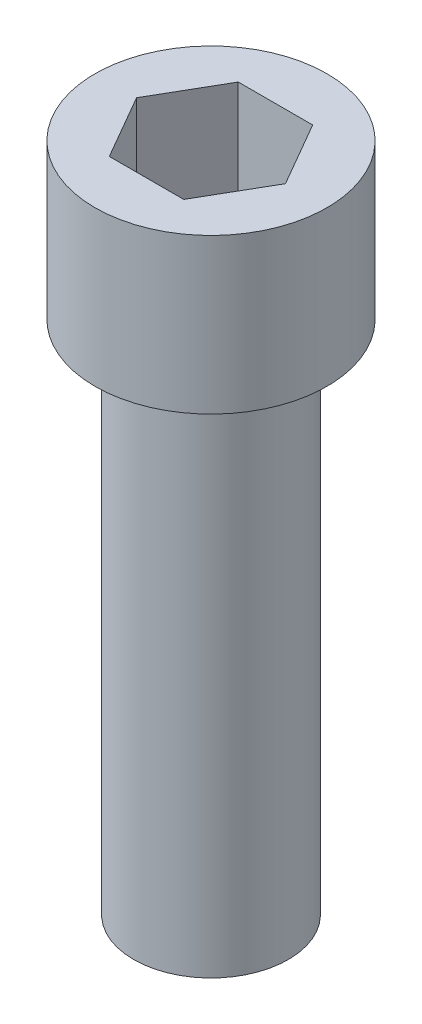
ISO-10303-21;
HEADER;
FILE_DESCRIPTION(('STEP AP214'),'2;1');
FILE_NAME('part.step','',(''),(''),'','','');
FILE_SCHEMA(('AUTOMOTIVE_DESIGN { 1 0 10303 214 1 1 1 1 }'));
ENDSEC;
DATA;
#1=APPLICATION_CONTEXT('core data for automotive mechanical design processes');
#2=APPLICATION_PROTOCOL_DEFINITION('international standard','automotive_design',2000,#1);
#3=PRODUCT_CONTEXT('',#1,'mechanical');
#4=PRODUCT('Part','Part','',(#3));
#5=PRODUCT_RELATED_PRODUCT_CATEGORY('part','',(#4));
#6=PRODUCT_DEFINITION_FORMATION('','',#4);
#7=PRODUCT_DEFINITION_CONTEXT('part definition',#1,'design');
#8=PRODUCT_DEFINITION('design','',#6,#7);
#9=PRODUCT_DEFINITION_SHAPE('','',#8);
#10=(LENGTH_UNIT() NAMED_UNIT(*) SI_UNIT(.MILLI.,.METRE.));
#11=(NAMED_UNIT(*) PLANE_ANGLE_UNIT() SI_UNIT($,.RADIAN.));
#12=(NAMED_UNIT(*) SI_UNIT($,.STERADIAN.) SOLID_ANGLE_UNIT());
#13=UNCERTAINTY_MEASURE_WITH_UNIT(LENGTH_MEASURE(1.E-05),#10,'distance_accuracy_value','');
#14=(GEOMETRIC_REPRESENTATION_CONTEXT(3) GLOBAL_UNCERTAINTY_ASSIGNED_CONTEXT((#13)) GLOBAL_UNIT_ASSIGNED_CONTEXT((#10,
#11,#12)) REPRESENTATION_CONTEXT('',''));
#15=CARTESIAN_POINT('',(0.,0.,0.));
#16=DIRECTION('',(0.,0.,1.));
#17=DIRECTION('',(1.,0.,0.));
#18=AXIS2_PLACEMENT_3D('',#15,#16,#17);
#19=CARTESIAN_POINT('',(0.,-63.5,0.));
#20=DIRECTION('',(0.,1.,0.));
#21=DIRECTION('',(0.,0.,1.));
#22=AXIS2_PLACEMENT_3D('',#19,#20,#21);
#23=CYLINDRICAL_SURFACE('',#22,9.525);
#24=CARTESIAN_POINT('',(0.,-63.5,0.));
#25=DIRECTION('',(0.,1.,0.));
#26=DIRECTION('',(0.,0.,1.));
#27=AXIS2_PLACEMENT_3D('',#24,#25,#26);
#28=CIRCLE('',#27,9.525);
#29=CARTESIAN_POINT('',(0.,-63.5,9.525));
#30=VERTEX_POINT('',#29);
#31=EDGE_CURVE('E11',#30,#30,#28,.T.);
#32=ORIENTED_EDGE('',*,*,#31,.T.);
#33=EDGE_LOOP('',(#32));
#34=FACE_BOUND('',#33,.T.);
#35=CARTESIAN_POINT('',(0.,0.,0.));
#36=DIRECTION('',(0.,1.,0.));
#37=DIRECTION('',(0.,0.,1.));
#38=AXIS2_PLACEMENT_3D('',#35,#36,#37);
#39=CIRCLE('',#38,9.525);
#40=CARTESIAN_POINT('',(0.,0.,9.525));
#41=VERTEX_POINT('',#40);
#42=EDGE_CURVE('E43',#41,#41,#39,.T.);
#43=ORIENTED_EDGE('',*,*,#42,.F.);
#44=EDGE_LOOP('',(#43));
#45=FACE_BOUND('',#44,.T.);
#46=ADVANCED_FACE('F40',(#34,#45),#23,.T.);
#47=CARTESIAN_POINT('',(0.,-63.5,0.));
#48=DIRECTION('',(0.,1.,0.));
#49=DIRECTION('',(0.,0.,1.));
#50=AXIS2_PLACEMENT_3D('',#47,#48,#49);
#51=PLANE('',#50);
#52=ORIENTED_EDGE('',*,*,#31,.F.);
#53=EDGE_LOOP('',(#52));
#54=FACE_BOUND('',#53,.T.);
#55=ADVANCED_FACE('F172',(#54),#51,.F.);
#56=CARTESIAN_POINT('',(0.,19.05,0.));
#57=DIRECTION('',(0.,-1.,0.));
#58=DIRECTION('',(0.,0.,-1.));
#59=AXIS2_PLACEMENT_3D('',#56,#57,#58);
#60=CYLINDRICAL_SURFACE('',#59,14.2875);
#61=CARTESIAN_POINT('',(0.,19.05,0.));
#62=DIRECTION('',(0.,1.,0.));
#63=DIRECTION('',(0.,0.,1.));
#64=AXIS2_PLACEMENT_3D('',#61,#62,#63);
#65=CIRCLE('',#64,14.2875);
#66=CARTESIAN_POINT('',(0.,19.05,-14.2875));
#67=VERTEX_POINT('',#66);
#68=EDGE_CURVE('E147',#67,#67,#65,.T.);
#69=CARTESIAN_POINT('',(0.,0.,0.));
#70=DIRECTION('',(0.,1.,0.));
#71=DIRECTION('',(0.,0.,1.));
#72=AXIS2_PLACEMENT_3D('',#69,#70,#71);
#73=CIRCLE('',#72,14.2875);
#74=CARTESIAN_POINT('',(0.,0.,-14.2875));
#75=VERTEX_POINT('',#74);
#76=EDGE_CURVE('E141',#75,#75,#73,.T.);
#77=CARTESIAN_POINT('',(0.,19.05,-14.2875));
#78=CARTESIAN_POINT('',(0.,18.8515625,-14.2875));
#79=CARTESIAN_POINT('',(0.,18.653125,-14.2875));
#80=CARTESIAN_POINT('',(0.,18.25625,-14.2875));
#81=CARTESIAN_POINT('',(0.,18.0578125,-14.2875));
#82=CARTESIAN_POINT('',(0.,17.6609375,-14.2875));
#83=CARTESIAN_POINT('',(0.,17.4625,-14.2875));
#84=CARTESIAN_POINT('',(0.,17.065625,-14.2875));
#85=CARTESIAN_POINT('',(0.,16.8671875,-14.2875));
#86=CARTESIAN_POINT('',(0.,16.4703125,-14.2875));
#87=CARTESIAN_POINT('',(0.,16.271875,-14.2875));
#88=CARTESIAN_POINT('',(0.,15.875,-14.2875));
#89=CARTESIAN_POINT('',(0.,15.6765625,-14.2875));
#90=CARTESIAN_POINT('',(0.,15.2796875,-14.2875));
#91=CARTESIAN_POINT('',(0.,15.08125,-14.2875));
#92=CARTESIAN_POINT('',(0.,14.684375,-14.2875));
#93=CARTESIAN_POINT('',(0.,14.4859375,-14.2875));
#94=CARTESIAN_POINT('',(0.,14.0890625,-14.2875));
#95=CARTESIAN_POINT('',(0.,13.890625,-14.2875));
#96=CARTESIAN_POINT('',(0.,13.49375,-14.2875));
#97=CARTESIAN_POINT('',(0.,13.2953125,-14.2875));
#98=CARTESIAN_POINT('',(0.,12.8984375,-14.2875));
#99=CARTESIAN_POINT('',(0.,12.7,-14.2875));
#100=CARTESIAN_POINT('',(0.,12.303125,-14.2875));
#101=CARTESIAN_POINT('',(0.,12.1046875,-14.2875));
#102=CARTESIAN_POINT('',(0.,11.7078125,-14.2875));
#103=CARTESIAN_POINT('',(0.,11.509375,-14.2875));
#104=CARTESIAN_POINT('',(0.,11.1125,-14.2875));
#105=CARTESIAN_POINT('',(0.,10.9140625,-14.2875));
#106=CARTESIAN_POINT('',(0.,10.5171875,-14.2875));
#107=CARTESIAN_POINT('',(0.,10.31875,-14.2875));
#108=CARTESIAN_POINT('',(0.,9.921875,-14.2875));
#109=CARTESIAN_POINT('',(0.,9.7234375,-14.2875));
#110=CARTESIAN_POINT('',(0.,9.3265625,-14.2875));
#111=CARTESIAN_POINT('',(0.,9.128125,-14.2875));
#112=CARTESIAN_POINT('',(0.,8.73125,-14.2875));
#113=CARTESIAN_POINT('',(0.,8.5328125,-14.2875));
#114=CARTESIAN_POINT('',(0.,8.1359375,-14.2875));
#115=CARTESIAN_POINT('',(0.,7.9375,-14.2875));
#116=CARTESIAN_POINT('',(0.,7.540625,-14.2875));
#117=CARTESIAN_POINT('',(0.,7.3421875,-14.2875));
#118=CARTESIAN_POINT('',(0.,6.9453125,-14.2875));
#119=CARTESIAN_POINT('',(0.,6.746875,-14.2875));
#120=CARTESIAN_POINT('',(0.,6.35,-14.2875));
#121=CARTESIAN_POINT('',(0.,6.1515625,-14.2875));
#122=CARTESIAN_POINT('',(0.,5.7546875,-14.2875));
#123=CARTESIAN_POINT('',(0.,5.55625,-14.2875));
#124=CARTESIAN_POINT('',(0.,5.159375,-14.2875));
#125=CARTESIAN_POINT('',(0.,4.9609375,-14.2875));
#126=CARTESIAN_POINT('',(0.,4.5640625,-14.2875));
#127=CARTESIAN_POINT('',(0.,4.365625,-14.2875));
#128=CARTESIAN_POINT('',(0.,3.96875,-14.2875));
#129=CARTESIAN_POINT('',(0.,3.7703125,-14.2875));
#130=CARTESIAN_POINT('',(0.,3.3734375,-14.2875));
#131=CARTESIAN_POINT('',(0.,3.175,-14.2875));
#132=CARTESIAN_POINT('',(0.,2.778125,-14.2875));
#133=CARTESIAN_POINT('',(0.,2.5796875,-14.2875));
#134=CARTESIAN_POINT('',(0.,2.1828125,-14.2875));
#135=CARTESIAN_POINT('',(0.,1.984375,-14.2875));
#136=CARTESIAN_POINT('',(0.,1.5875,-14.2875));
#137=CARTESIAN_POINT('',(0.,1.3890625,-14.2875));
#138=CARTESIAN_POINT('',(0.,0.992187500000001,-14.2875));
#139=CARTESIAN_POINT('',(0.,0.793750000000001,-14.2875));
#140=CARTESIAN_POINT('',(0.,0.396875,-14.2875));
#141=CARTESIAN_POINT('',(0.,0.1984375,-14.2875));
#142=CARTESIAN_POINT('',(0.,0.,-14.2875));
#143=B_SPLINE_CURVE_WITH_KNOTS('',3,(#77,#78,#79,#80,#81,#82,#83,#84,#85,#86,#87,#88,#89,#90,
#91,#92,#93,#94,#95,#96,#97,#98,#99,#100,#101,#102,#103,#104,#105,#106,#107,#108,#109,#110,#111,
#112,#113,#114,#115,#116,#117,#118,#119,#120,#121,#122,#123,#124,#125,#126,#127,#128,#129,#130,
#131,#132,#133,#134,#135,#136,#137,#138,#139,#140,#141,#142),.UNSPECIFIED.,.F.,.F.,(4,2,2,2,2,2,
2,2,2,2,2,2,2,2,2,2,2,2,2,2,2,2,2,2,2,2,2,2,2,2,2,2,4),(0.,0.5953125,1.190625,1.7859375,2.38125,
2.9765625,3.571875,4.1671875,4.7625,5.3578125,5.953125,6.5484375,7.14375,7.7390625,8.334375,
8.9296875,9.525,10.1203125,10.715625,11.3109375,11.90625,12.5015625,13.096875,13.6921875,
14.2875,14.8828125,15.478125,16.0734375,16.66875,17.2640625,17.859375,18.4546875,19.05),.UNSPECIFIED.);
#144=EDGE_CURVE('BSEAM153',#67,#75,#143,.T.);
#145=ORIENTED_EDGE('',*,*,#68,.F.);
#146=ORIENTED_EDGE('',*,*,#76,.T.);
#147=ORIENTED_EDGE('',*,*,#144,.T.);
#148=ORIENTED_EDGE('',*,*,#144,.F.);
#149=EDGE_LOOP('',(#145,#147,#146,#148));
#150=FACE_BOUND('',#149,.T.);
#151=ADVANCED_FACE('F153',(#150),#60,.T.);
#152=CARTESIAN_POINT('',(0.,19.05,0.));
#153=DIRECTION('',(0.,1.,0.));
#154=DIRECTION('',(0.,0.,1.));
#155=AXIS2_PLACEMENT_3D('',#152,#153,#154);
#156=PLANE('',#155);
#157=DIRECTION('',(0.5,0.,-0.866025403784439));
#158=VECTOR('',#157,1.);
#159=CARTESIAN_POINT('',(4.58271776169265,19.05,7.93750000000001));
#160=LINE('',#159,#158);
#161=CARTESIAN_POINT('',(4.58271776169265,19.05,7.93750000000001));
#162=VERTEX_POINT('',#161);
#163=CARTESIAN_POINT('',(9.16543552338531,19.05,0.));
#164=VERTEX_POINT('',#163);
#165=EDGE_CURVE('E54',#162,#164,#160,.T.);
#166=ORIENTED_EDGE('',*,*,#165,.F.);
#167=DIRECTION('',(1.,0.,0.));
#168=VECTOR('',#167,1.);
#169=CARTESIAN_POINT('',(-4.58271776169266,19.05,7.9375));
#170=LINE('',#169,#168);
#171=CARTESIAN_POINT('',(-4.58271776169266,19.05,7.9375));
#172=VERTEX_POINT('',#171);
#173=EDGE_CURVE('E137',#172,#162,#170,.T.);
#174=ORIENTED_EDGE('',*,*,#173,.F.);
#175=DIRECTION('',(0.5,0.,0.866025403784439));
#176=VECTOR('',#175,1.);
#177=CARTESIAN_POINT('',(-9.16543552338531,19.05,0.));
#178=LINE('',#177,#176);
#179=CARTESIAN_POINT('',(-9.16543552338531,19.05,0.));
#180=VERTEX_POINT('',#179);
#181=EDGE_CURVE('E135',#180,#172,#178,.T.);
#182=ORIENTED_EDGE('',*,*,#181,.F.);
#183=DIRECTION('',(-0.5,0.,0.866025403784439));
#184=VECTOR('',#183,1.);
#185=CARTESIAN_POINT('',(-4.58271776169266,19.05,-7.93750000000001));
#186=LINE('',#185,#184);
#187=CARTESIAN_POINT('',(-4.58271776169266,19.05,-7.93750000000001));
#188=VERTEX_POINT('',#187);
#189=EDGE_CURVE('E102',#188,#180,#186,.T.);
#190=ORIENTED_EDGE('',*,*,#189,.F.);
#191=DIRECTION('',(-1.,0.,0.));
#192=VECTOR('',#191,1.);
#193=CARTESIAN_POINT('',(4.58271776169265,19.05,-7.93750000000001));
#194=LINE('',#193,#192);
#195=CARTESIAN_POINT('',(4.58271776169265,19.05,-7.93750000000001));
#196=VERTEX_POINT('',#195);
#197=EDGE_CURVE('E131',#196,#188,#194,.T.);
#198=ORIENTED_EDGE('',*,*,#197,.F.);
#199=DIRECTION('',(-0.5,0.,-0.866025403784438));
#200=VECTOR('',#199,1.);
#201=CARTESIAN_POINT('',(9.16543552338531,19.05,0.));
#202=LINE('',#201,#200);
#203=EDGE_CURVE('E128',#164,#196,#202,.T.);
#204=ORIENTED_EDGE('',*,*,#203,.F.);
#205=EDGE_LOOP('',(#166,#174,#182,#190,#198,#204));
#206=FACE_BOUND('',#205,.T.);
#207=ORIENTED_EDGE('',*,*,#68,.T.);
#208=EDGE_LOOP('',(#207));
#209=FACE_BOUND('',#208,.T.);
#210=ADVANCED_FACE('F158',(#206,#209),#156,.T.);
#211=CARTESIAN_POINT('',(0.,0.,0.));
#212=DIRECTION('',(0.,1.,0.));
#213=DIRECTION('',(0.,0.,1.));
#214=AXIS2_PLACEMENT_3D('',#211,#212,#213);
#215=PLANE('',#214);
#216=ORIENTED_EDGE('',*,*,#42,.T.);
#217=EDGE_LOOP('',(#216));
#218=FACE_BOUND('',#217,.T.);
#219=ORIENTED_EDGE('',*,*,#76,.F.);
#220=EDGE_LOOP('',(#219));
#221=FACE_BOUND('',#220,.T.);
#222=ADVANCED_FACE('F155',(#218,#221),#215,.F.);
#223=CARTESIAN_POINT('',(4.58271776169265,6.35,7.93750000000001));
#224=DIRECTION('',(0.866025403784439,0.,0.5));
#225=DIRECTION('',(0.5,0.,-0.866025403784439));
#226=AXIS2_PLACEMENT_3D('',#223,#224,#225);
#227=PLANE('',#226);
#228=ORIENTED_EDGE('',*,*,#165,.T.);
#229=DIRECTION('',(0.,1.,0.));
#230=VECTOR('',#229,1.);
#231=CARTESIAN_POINT('',(9.16543552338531,6.35,0.));
#232=LINE('',#231,#230);
#233=CARTESIAN_POINT('',(9.16543552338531,6.35,0.));
#234=VERTEX_POINT('',#233);
#235=EDGE_CURVE('E84',#234,#164,#232,.T.);
#236=ORIENTED_EDGE('',*,*,#235,.F.);
#237=DIRECTION('',(0.5,0.,-0.866025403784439));
#238=VECTOR('',#237,1.);
#239=CARTESIAN_POINT('',(4.58271776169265,6.35,7.93750000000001));
#240=LINE('',#239,#238);
#241=CARTESIAN_POINT('',(4.58271776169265,6.35,7.93750000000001));
#242=VERTEX_POINT('',#241);
#243=EDGE_CURVE('E139',#242,#234,#240,.T.);
#244=ORIENTED_EDGE('',*,*,#243,.F.);
#245=DIRECTION('',(0.,1.,0.));
#246=VECTOR('',#245,1.);
#247=CARTESIAN_POINT('',(4.58271776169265,6.35,7.93750000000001));
#248=LINE('',#247,#246);
#249=EDGE_CURVE('E62',#242,#162,#248,.T.);
#250=ORIENTED_EDGE('',*,*,#249,.T.);
#251=EDGE_LOOP('',(#228,#236,#244,#250));
#252=FACE_BOUND('',#251,.T.);
#253=ADVANCED_FACE('F157',(#252),#227,.F.);
#254=CARTESIAN_POINT('',(-4.58271776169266,6.35,7.9375));
#255=DIRECTION('',(0.,0.,1.));
#256=DIRECTION('',(1.,0.,0.));
#257=AXIS2_PLACEMENT_3D('',#254,#255,#256);
#258=PLANE('',#257);
#259=ORIENTED_EDGE('',*,*,#173,.T.);
#260=ORIENTED_EDGE('',*,*,#249,.F.);
#261=DIRECTION('',(1.,0.,0.));
#262=VECTOR('',#261,1.);
#263=CARTESIAN_POINT('',(-4.58271776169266,6.35,7.9375));
#264=LINE('',#263,#262);
#265=CARTESIAN_POINT('',(-4.58271776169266,6.35,7.9375));
#266=VERTEX_POINT('',#265);
#267=EDGE_CURVE('E114',#266,#242,#264,.T.);
#268=ORIENTED_EDGE('',*,*,#267,.F.);
#269=DIRECTION('',(0.,1.,0.));
#270=VECTOR('',#269,1.);
#271=CARTESIAN_POINT('',(-4.58271776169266,6.35,7.9375));
#272=LINE('',#271,#270);
#273=EDGE_CURVE('E106',#266,#172,#272,.T.);
#274=ORIENTED_EDGE('',*,*,#273,.T.);
#275=EDGE_LOOP('',(#259,#260,#268,#274));
#276=FACE_BOUND('',#275,.T.);
#277=ADVANCED_FACE('F165',(#276),#258,.F.);
#278=CARTESIAN_POINT('',(-9.16543552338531,6.35,0.));
#279=DIRECTION('',(-0.866025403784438,0.,0.5));
#280=DIRECTION('',(0.5,0.,0.866025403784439));
#281=AXIS2_PLACEMENT_3D('',#278,#279,#280);
#282=PLANE('',#281);
#283=ORIENTED_EDGE('',*,*,#181,.T.);
#284=ORIENTED_EDGE('',*,*,#273,.F.);
#285=DIRECTION('',(0.5,0.,0.866025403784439));
#286=VECTOR('',#285,1.);
#287=CARTESIAN_POINT('',(-9.16543552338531,6.35,0.));
#288=LINE('',#287,#286);
#289=CARTESIAN_POINT('',(-9.16543552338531,6.35,0.));
#290=VERTEX_POINT('',#289);
#291=EDGE_CURVE('E110',#290,#266,#288,.T.);
#292=ORIENTED_EDGE('',*,*,#291,.F.);
#293=DIRECTION('',(0.,1.,0.));
#294=VECTOR('',#293,1.);
#295=CARTESIAN_POINT('',(-9.16543552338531,6.35,0.));
#296=LINE('',#295,#294);
#297=EDGE_CURVE('E95',#290,#180,#296,.T.);
#298=ORIENTED_EDGE('',*,*,#297,.T.);
#299=EDGE_LOOP('',(#283,#284,#292,#298));
#300=FACE_BOUND('',#299,.T.);
#301=ADVANCED_FACE('F111',(#300),#282,.F.);
#302=CARTESIAN_POINT('',(-4.58271776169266,6.35,-7.93750000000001));
#303=DIRECTION('',(-0.866025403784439,0.,-0.5));
#304=DIRECTION('',(-0.5,0.,0.866025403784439));
#305=AXIS2_PLACEMENT_3D('',#302,#303,#304);
#306=PLANE('',#305);
#307=ORIENTED_EDGE('',*,*,#189,.T.);
#308=ORIENTED_EDGE('',*,*,#297,.F.);
#309=DIRECTION('',(-0.5,0.,0.866025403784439));
#310=VECTOR('',#309,1.);
#311=CARTESIAN_POINT('',(-4.58271776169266,6.35,-7.93750000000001));
#312=LINE('',#311,#310);
#313=CARTESIAN_POINT('',(-4.58271776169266,6.35,-7.93750000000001));
#314=VERTEX_POINT('',#313);
#315=EDGE_CURVE('E99',#314,#290,#312,.T.);
#316=ORIENTED_EDGE('',*,*,#315,.F.);
#317=DIRECTION('',(0.,1.,0.));
#318=VECTOR('',#317,1.);
#319=CARTESIAN_POINT('',(-4.58271776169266,6.35,-7.93750000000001));
#320=LINE('',#319,#318);
#321=EDGE_CURVE('E107',#314,#188,#320,.T.);
#322=ORIENTED_EDGE('',*,*,#321,.T.);
#323=EDGE_LOOP('',(#307,#308,#316,#322));
#324=FACE_BOUND('',#323,.T.);
#325=ADVANCED_FACE('F97',(#324),#306,.F.);
#326=CARTESIAN_POINT('',(4.58271776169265,6.35,-7.93750000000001));
#327=DIRECTION('',(0.,0.,-1.));
#328=DIRECTION('',(-1.,0.,0.));
#329=AXIS2_PLACEMENT_3D('',#326,#327,#328);
#330=PLANE('',#329);
#331=ORIENTED_EDGE('',*,*,#197,.T.);
#332=ORIENTED_EDGE('',*,*,#321,.F.);
#333=DIRECTION('',(-1.,0.,0.));
#334=VECTOR('',#333,1.);
#335=CARTESIAN_POINT('',(4.58271776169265,6.35,-7.93750000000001));
#336=LINE('',#335,#334);
#337=CARTESIAN_POINT('',(4.58271776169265,6.35,-7.93750000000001));
#338=VERTEX_POINT('',#337);
#339=EDGE_CURVE('E120',#338,#314,#336,.T.);
#340=ORIENTED_EDGE('',*,*,#339,.F.);
#341=DIRECTION('',(0.,1.,0.));
#342=VECTOR('',#341,1.);
#343=CARTESIAN_POINT('',(4.58271776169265,6.35,-7.93750000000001));
#344=LINE('',#343,#342);
#345=EDGE_CURVE('E144',#338,#196,#344,.T.);
#346=ORIENTED_EDGE('',*,*,#345,.T.);
#347=EDGE_LOOP('',(#331,#332,#340,#346));
#348=FACE_BOUND('',#347,.T.);
#349=ADVANCED_FACE('F226',(#348),#330,.F.);
#350=CARTESIAN_POINT('',(9.16543552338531,6.35,0.));
#351=DIRECTION('',(0.866025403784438,0.,-0.5));
#352=DIRECTION('',(-0.5,0.,-0.866025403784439));
#353=AXIS2_PLACEMENT_3D('',#350,#351,#352);
#354=PLANE('',#353);
#355=ORIENTED_EDGE('',*,*,#203,.T.);
#356=ORIENTED_EDGE('',*,*,#345,.F.);
#357=DIRECTION('',(-0.5,0.,-0.866025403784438));
#358=VECTOR('',#357,1.);
#359=CARTESIAN_POINT('',(9.16543552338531,6.35,0.));
#360=LINE('',#359,#358);
#361=EDGE_CURVE('E122',#234,#338,#360,.T.);
#362=ORIENTED_EDGE('',*,*,#361,.F.);
#363=ORIENTED_EDGE('',*,*,#235,.T.);
#364=EDGE_LOOP('',(#355,#356,#362,#363));
#365=FACE_BOUND('',#364,.T.);
#366=ADVANCED_FACE('F235',(#365),#354,.F.);
#367=CARTESIAN_POINT('',(0.,6.35,0.));
#368=DIRECTION('',(0.,1.,0.));
#369=DIRECTION('',(0.,0.,1.));
#370=AXIS2_PLACEMENT_3D('',#367,#368,#369);
#371=PLANE('',#370);
#372=ORIENTED_EDGE('',*,*,#243,.T.);
#373=ORIENTED_EDGE('',*,*,#361,.T.);
#374=ORIENTED_EDGE('',*,*,#339,.T.);
#375=ORIENTED_EDGE('',*,*,#315,.T.);
#376=ORIENTED_EDGE('',*,*,#291,.T.);
#377=ORIENTED_EDGE('',*,*,#267,.T.);
#378=EDGE_LOOP('',(#372,#373,#374,#375,#376,#377));
#379=FACE_BOUND('',#378,.T.);
#380=ADVANCED_FACE('F117',(#379),#371,.T.);
#381=CLOSED_SHELL('',(#46,#55,#151,#210,#222,#253,#277,#301,#325,#349,#366,#380));
#382=MANIFOLD_SOLID_BREP('B2',#381);
#383=ADVANCED_BREP_SHAPE_REPRESENTATION('',(#18,#382),#14);
#384=SHAPE_DEFINITION_REPRESENTATION(#9,#383);
ENDSEC;
END-ISO-10303-21;
